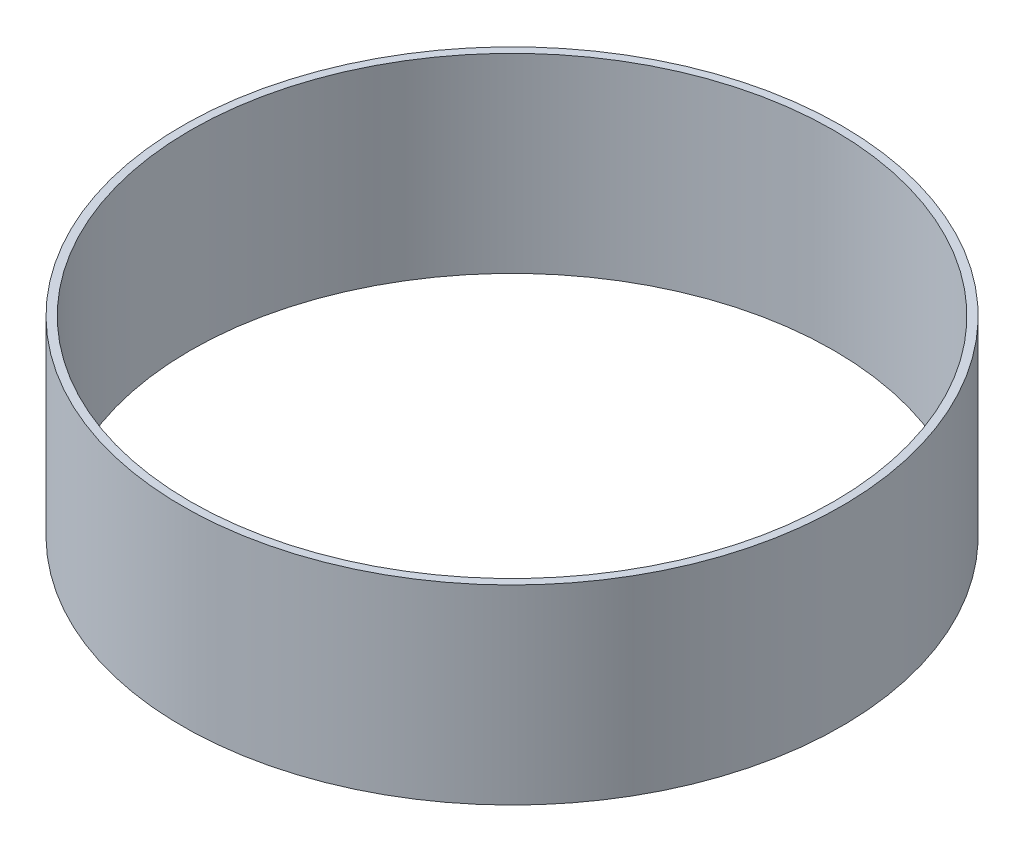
from build123d import *

# Parameters (mm, degrees)
SKETCH1_R      = 263.525
SKETCH1_R_2    = 257.175
EXTRUDE1_DEPTH = 152.4


with BuildPart() as part:
    # Sketch1 → Extrude1 (new body)
    with BuildSketch(Plane(origin=(0, 0, 0), x_dir=(1, 0, 0), z_dir=(0, 1, 0))):
        with Locations(Location((0, 0, 0), (0, 0, 90))):
            Circle(SKETCH1_R)
        with Locations(Location((0, 0, 0), (0, 0, 90))):
            Circle(SKETCH1_R_2, mode=Mode.SUBTRACT)
    extrude(amount=EXTRUDE1_DEPTH)


solid = part.part
